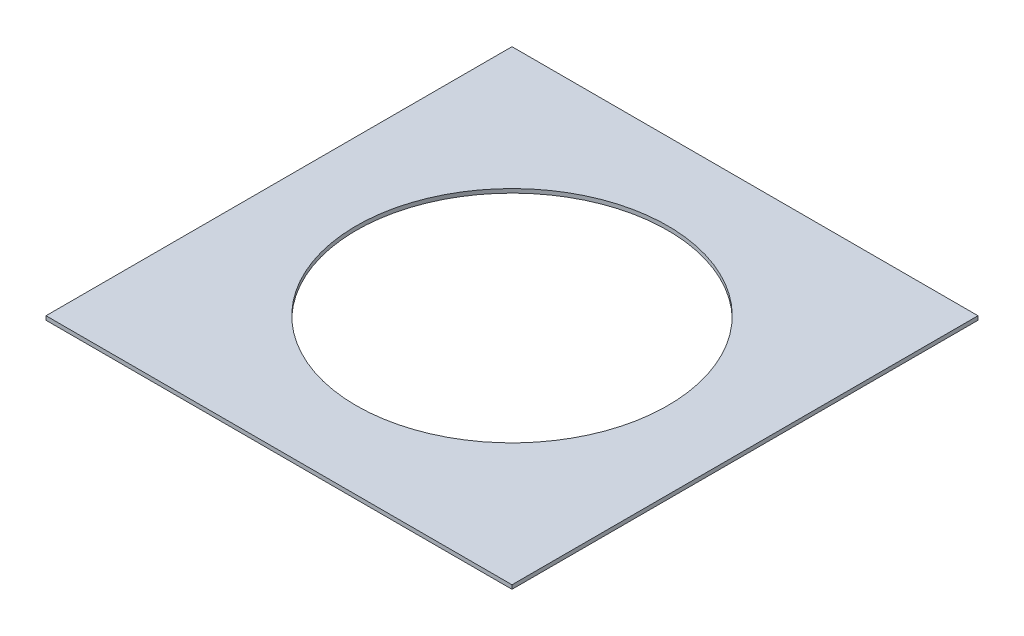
ISO-10303-21;
HEADER;
FILE_DESCRIPTION(('STEP AP214'),'2;1');
FILE_NAME('part.step','',(''),(''),'','','');
FILE_SCHEMA(('AUTOMOTIVE_DESIGN { 1 0 10303 214 1 1 1 1 }'));
ENDSEC;
DATA;
#1=APPLICATION_CONTEXT('core data for automotive mechanical design processes');
#2=APPLICATION_PROTOCOL_DEFINITION('international standard','automotive_design',2000,#1);
#3=PRODUCT_CONTEXT('',#1,'mechanical');
#4=PRODUCT('Part','Part','',(#3));
#5=PRODUCT_RELATED_PRODUCT_CATEGORY('part','',(#4));
#6=PRODUCT_DEFINITION_FORMATION('','',#4);
#7=PRODUCT_DEFINITION_CONTEXT('part definition',#1,'design');
#8=PRODUCT_DEFINITION('design','',#6,#7);
#9=PRODUCT_DEFINITION_SHAPE('','',#8);
#10=(LENGTH_UNIT() NAMED_UNIT(*) SI_UNIT(.MILLI.,.METRE.));
#11=(NAMED_UNIT(*) PLANE_ANGLE_UNIT() SI_UNIT($,.RADIAN.));
#12=(NAMED_UNIT(*) SI_UNIT($,.STERADIAN.) SOLID_ANGLE_UNIT());
#13=UNCERTAINTY_MEASURE_WITH_UNIT(LENGTH_MEASURE(1.E-05),#10,'distance_accuracy_value','');
#14=(GEOMETRIC_REPRESENTATION_CONTEXT(3) GLOBAL_UNCERTAINTY_ASSIGNED_CONTEXT((#13)) GLOBAL_UNIT_ASSIGNED_CONTEXT((#10,
#11,#12)) REPRESENTATION_CONTEXT('',''));
#15=CARTESIAN_POINT('',(0.,0.,0.));
#16=DIRECTION('',(0.,0.,1.));
#17=DIRECTION('',(1.,0.,0.));
#18=AXIS2_PLACEMENT_3D('',#15,#16,#17);
#19=CARTESIAN_POINT('',(0.,1.5875,0.));
#20=DIRECTION('',(0.,-1.,0.));
#21=DIRECTION('',(0.,0.,-1.));
#22=AXIS2_PLACEMENT_3D('',#19,#20,#21);
#23=PLANE('',#22);
#24=DIRECTION('',(0.,0.,-1.));
#25=VECTOR('',#24,1.);
#26=CARTESIAN_POINT('',(93.472,1.5875,93.472));
#27=LINE('',#26,#25);
#28=CARTESIAN_POINT('',(93.472,1.5875,93.472));
#29=VERTEX_POINT('',#28);
#30=CARTESIAN_POINT('',(93.472,1.5875,-93.472));
#31=VERTEX_POINT('',#30);
#32=EDGE_CURVE('E100',#29,#31,#27,.T.);
#33=ORIENTED_EDGE('',*,*,#32,.T.);
#34=DIRECTION('',(-1.,0.,0.));
#35=VECTOR('',#34,1.);
#36=CARTESIAN_POINT('',(-93.472,1.5875,-93.472));
#37=LINE('',#36,#35);
#38=CARTESIAN_POINT('',(-93.472,1.5875,-93.472));
#39=VERTEX_POINT('',#38);
#40=EDGE_CURVE('E95',#31,#39,#37,.T.);
#41=ORIENTED_EDGE('',*,*,#40,.T.);
#42=DIRECTION('',(0.,0.,1.));
#43=VECTOR('',#42,1.);
#44=CARTESIAN_POINT('',(-93.472,1.5875,93.472));
#45=LINE('',#44,#43);
#46=CARTESIAN_POINT('',(-93.472,1.5875,93.472));
#47=VERTEX_POINT('',#46);
#48=EDGE_CURVE('E98',#39,#47,#45,.T.);
#49=ORIENTED_EDGE('',*,*,#48,.T.);
#50=DIRECTION('',(1.,0.,0.));
#51=VECTOR('',#50,1.);
#52=CARTESIAN_POINT('',(-93.472,1.5875,93.472));
#53=LINE('',#52,#51);
#54=EDGE_CURVE('E65',#47,#29,#53,.T.);
#55=ORIENTED_EDGE('',*,*,#54,.T.);
#56=EDGE_LOOP('',(#33,#41,#49,#55));
#57=FACE_BOUND('',#56,.T.);
#58=CARTESIAN_POINT('',(0.,1.5875,0.));
#59=DIRECTION('',(0.,1.,0.));
#60=DIRECTION('',(0.,0.,1.));
#61=AXIS2_PLACEMENT_3D('',#58,#59,#60);
#62=CIRCLE('',#61,62.484);
#63=CARTESIAN_POINT('',(0.,1.5875,62.484));
#64=VERTEX_POINT('',#63);
#65=EDGE_CURVE('E120',#64,#64,#62,.T.);
#66=ORIENTED_EDGE('',*,*,#65,.F.);
#67=EDGE_LOOP('',(#66));
#68=FACE_BOUND('',#67,.T.);
#69=ADVANCED_FACE('F47',(#57,#68),#23,.F.);
#70=CARTESIAN_POINT('',(0.,0.,0.));
#71=DIRECTION('',(0.,-1.,0.));
#72=DIRECTION('',(0.,0.,-1.));
#73=AXIS2_PLACEMENT_3D('',#70,#71,#72);
#74=PLANE('',#73);
#75=DIRECTION('',(0.,0.,-1.));
#76=VECTOR('',#75,1.);
#77=CARTESIAN_POINT('',(93.472,0.,93.472));
#78=LINE('',#77,#76);
#79=CARTESIAN_POINT('',(93.472,0.,93.472));
#80=VERTEX_POINT('',#79);
#81=CARTESIAN_POINT('',(93.472,0.,-93.472));
#82=VERTEX_POINT('',#81);
#83=EDGE_CURVE('E116',#80,#82,#78,.T.);
#84=ORIENTED_EDGE('',*,*,#83,.F.);
#85=DIRECTION('',(1.,0.,0.));
#86=VECTOR('',#85,1.);
#87=CARTESIAN_POINT('',(-93.472,0.,93.472));
#88=LINE('',#87,#86);
#89=CARTESIAN_POINT('',(-93.472,0.,93.472));
#90=VERTEX_POINT('',#89);
#91=EDGE_CURVE('E88',#90,#80,#88,.T.);
#92=ORIENTED_EDGE('',*,*,#91,.F.);
#93=DIRECTION('',(0.,0.,1.));
#94=VECTOR('',#93,1.);
#95=CARTESIAN_POINT('',(-93.472,0.,93.472));
#96=LINE('',#95,#94);
#97=CARTESIAN_POINT('',(-93.472,0.,-93.472));
#98=VERTEX_POINT('',#97);
#99=EDGE_CURVE('E82',#98,#90,#96,.T.);
#100=ORIENTED_EDGE('',*,*,#99,.F.);
#101=DIRECTION('',(-1.,0.,0.));
#102=VECTOR('',#101,1.);
#103=CARTESIAN_POINT('',(-93.472,0.,-93.472));
#104=LINE('',#103,#102);
#105=EDGE_CURVE('E105',#82,#98,#104,.T.);
#106=ORIENTED_EDGE('',*,*,#105,.F.);
#107=EDGE_LOOP('',(#84,#92,#100,#106));
#108=FACE_BOUND('',#107,.T.);
#109=CARTESIAN_POINT('',(0.,0.,0.));
#110=DIRECTION('',(0.,1.,0.));
#111=DIRECTION('',(0.,0.,1.));
#112=AXIS2_PLACEMENT_3D('',#109,#110,#111);
#113=CIRCLE('',#112,62.484);
#114=CARTESIAN_POINT('',(0.,0.,62.484));
#115=VERTEX_POINT('',#114);
#116=EDGE_CURVE('E138',#115,#115,#113,.T.);
#117=ORIENTED_EDGE('',*,*,#116,.T.);
#118=EDGE_LOOP('',(#117));
#119=FACE_BOUND('',#118,.T.);
#120=ADVANCED_FACE('F133',(#108,#119),#74,.T.);
#121=CARTESIAN_POINT('',(93.472,1.5875,93.472));
#122=DIRECTION('',(-1.,0.,0.));
#123=DIRECTION('',(0.,0.,1.));
#124=AXIS2_PLACEMENT_3D('',#121,#122,#123);
#125=PLANE('',#124);
#126=ORIENTED_EDGE('',*,*,#83,.T.);
#127=DIRECTION('',(0.,-1.,0.));
#128=VECTOR('',#127,1.);
#129=CARTESIAN_POINT('',(93.472,1.5875,-93.472));
#130=LINE('',#129,#128);
#131=EDGE_CURVE('E11',#31,#82,#130,.T.);
#132=ORIENTED_EDGE('',*,*,#131,.F.);
#133=ORIENTED_EDGE('',*,*,#32,.F.);
#134=DIRECTION('',(0.,-1.,0.));
#135=VECTOR('',#134,1.);
#136=CARTESIAN_POINT('',(93.472,1.5875,93.472));
#137=LINE('',#136,#135);
#138=EDGE_CURVE('E112',#29,#80,#137,.T.);
#139=ORIENTED_EDGE('',*,*,#138,.T.);
#140=EDGE_LOOP('',(#126,#132,#133,#139));
#141=FACE_BOUND('',#140,.T.);
#142=ADVANCED_FACE('F49',(#141),#125,.F.);
#143=CARTESIAN_POINT('',(-93.472,1.5875,-93.472));
#144=DIRECTION('',(0.,0.,1.));
#145=DIRECTION('',(1.,0.,0.));
#146=AXIS2_PLACEMENT_3D('',#143,#144,#145);
#147=PLANE('',#146);
#148=ORIENTED_EDGE('',*,*,#105,.T.);
#149=DIRECTION('',(0.,-1.,0.));
#150=VECTOR('',#149,1.);
#151=CARTESIAN_POINT('',(-93.472,1.5875,-93.472));
#152=LINE('',#151,#150);
#153=EDGE_CURVE('E57',#39,#98,#152,.T.);
#154=ORIENTED_EDGE('',*,*,#153,.F.);
#155=ORIENTED_EDGE('',*,*,#40,.F.);
#156=ORIENTED_EDGE('',*,*,#131,.T.);
#157=EDGE_LOOP('',(#148,#154,#155,#156));
#158=FACE_BOUND('',#157,.T.);
#159=ADVANCED_FACE('F104',(#158),#147,.F.);
#160=CARTESIAN_POINT('',(-93.472,1.5875,93.472));
#161=DIRECTION('',(1.,0.,0.));
#162=DIRECTION('',(0.,0.,-1.));
#163=AXIS2_PLACEMENT_3D('',#160,#161,#162);
#164=PLANE('',#163);
#165=ORIENTED_EDGE('',*,*,#99,.T.);
#166=DIRECTION('',(0.,-1.,0.));
#167=VECTOR('',#166,1.);
#168=CARTESIAN_POINT('',(-93.472,1.5875,93.472));
#169=LINE('',#168,#167);
#170=EDGE_CURVE('E107',#47,#90,#169,.T.);
#171=ORIENTED_EDGE('',*,*,#170,.F.);
#172=ORIENTED_EDGE('',*,*,#48,.F.);
#173=ORIENTED_EDGE('',*,*,#153,.T.);
#174=EDGE_LOOP('',(#165,#171,#172,#173));
#175=FACE_BOUND('',#174,.T.);
#176=ADVANCED_FACE('F108',(#175),#164,.F.);
#177=CARTESIAN_POINT('',(-93.472,1.5875,93.472));
#178=DIRECTION('',(0.,0.,-1.));
#179=DIRECTION('',(-1.,0.,0.));
#180=AXIS2_PLACEMENT_3D('',#177,#178,#179);
#181=PLANE('',#180);
#182=ORIENTED_EDGE('',*,*,#91,.T.);
#183=ORIENTED_EDGE('',*,*,#138,.F.);
#184=ORIENTED_EDGE('',*,*,#54,.F.);
#185=ORIENTED_EDGE('',*,*,#170,.T.);
#186=EDGE_LOOP('',(#182,#183,#184,#185));
#187=FACE_BOUND('',#186,.T.);
#188=ADVANCED_FACE('F130',(#187),#181,.F.);
#189=CARTESIAN_POINT('',(0.,1.5875,0.));
#190=DIRECTION('',(0.,-1.,0.));
#191=DIRECTION('',(0.,0.,-1.));
#192=AXIS2_PLACEMENT_3D('',#189,#190,#191);
#193=CYLINDRICAL_SURFACE('',#192,62.484);
#194=ORIENTED_EDGE('',*,*,#65,.T.);
#195=EDGE_LOOP('',(#194));
#196=FACE_BOUND('',#195,.T.);
#197=ORIENTED_EDGE('',*,*,#116,.F.);
#198=EDGE_LOOP('',(#197));
#199=FACE_BOUND('',#198,.T.);
#200=ADVANCED_FACE('F146',(#196,#199),#193,.F.);
#201=CLOSED_SHELL('',(#69,#120,#142,#159,#176,#188,#200));
#202=MANIFOLD_SOLID_BREP('B2',#201);
#203=ADVANCED_BREP_SHAPE_REPRESENTATION('',(#18,#202),#14);
#204=SHAPE_DEFINITION_REPRESENTATION(#9,#203);
ENDSEC;
END-ISO-10303-21;
